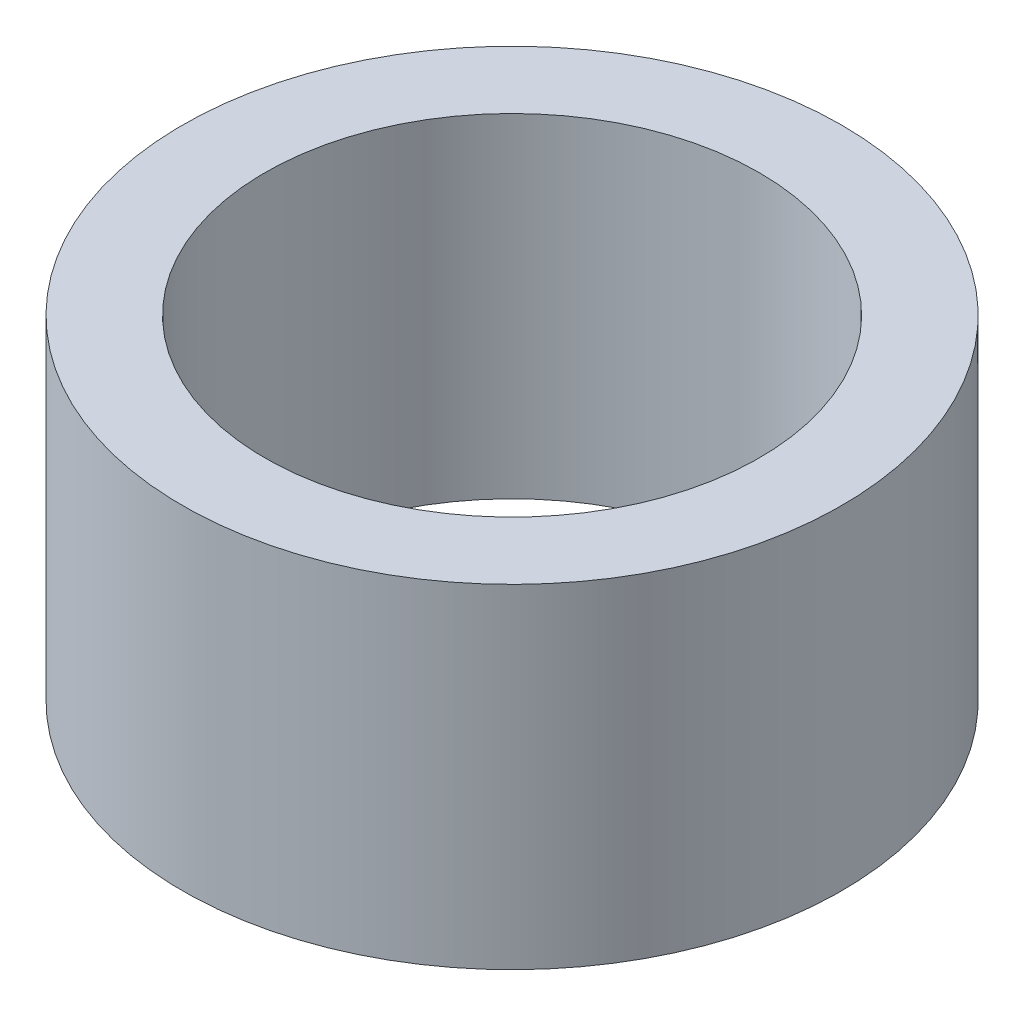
ISO-10303-21;
HEADER;
FILE_DESCRIPTION(('STEP AP214'),'2;1');
FILE_NAME('part.step','',(''),(''),'','','');
FILE_SCHEMA(('AUTOMOTIVE_DESIGN { 1 0 10303 214 1 1 1 1 }'));
ENDSEC;
DATA;
#1=APPLICATION_CONTEXT('core data for automotive mechanical design processes');
#2=APPLICATION_PROTOCOL_DEFINITION('international standard','automotive_design',2000,#1);
#3=PRODUCT_CONTEXT('',#1,'mechanical');
#4=PRODUCT('Part','Part','',(#3));
#5=PRODUCT_RELATED_PRODUCT_CATEGORY('part','',(#4));
#6=PRODUCT_DEFINITION_FORMATION('','',#4);
#7=PRODUCT_DEFINITION_CONTEXT('part definition',#1,'design');
#8=PRODUCT_DEFINITION('design','',#6,#7);
#9=PRODUCT_DEFINITION_SHAPE('','',#8);
#10=(LENGTH_UNIT() NAMED_UNIT(*) SI_UNIT(.MILLI.,.METRE.));
#11=(NAMED_UNIT(*) PLANE_ANGLE_UNIT() SI_UNIT($,.RADIAN.));
#12=(NAMED_UNIT(*) SI_UNIT($,.STERADIAN.) SOLID_ANGLE_UNIT());
#13=UNCERTAINTY_MEASURE_WITH_UNIT(LENGTH_MEASURE(1.E-05),#10,'distance_accuracy_value','');
#14=(GEOMETRIC_REPRESENTATION_CONTEXT(3) GLOBAL_UNCERTAINTY_ASSIGNED_CONTEXT((#13)) GLOBAL_UNIT_ASSIGNED_CONTEXT((#10,
#11,#12)) REPRESENTATION_CONTEXT('',''));
#15=CARTESIAN_POINT('',(0.,0.,0.));
#16=DIRECTION('',(0.,0.,1.));
#17=DIRECTION('',(1.,0.,0.));
#18=AXIS2_PLACEMENT_3D('',#15,#16,#17);
#19=CARTESIAN_POINT('',(0.,4.05,0.));
#20=DIRECTION('',(0.,-1.,0.));
#21=DIRECTION('',(0.,0.,-1.));
#22=AXIS2_PLACEMENT_3D('',#19,#20,#21);
#23=CYLINDRICAL_SURFACE('',#22,4.);
#24=CARTESIAN_POINT('',(0.,4.05,0.));
#25=DIRECTION('',(0.,-1.,0.));
#26=DIRECTION('',(0.,0.,-1.));
#27=AXIS2_PLACEMENT_3D('',#24,#25,#26);
#28=CIRCLE('',#27,4.);
#29=CARTESIAN_POINT('',(0.,4.05,-4.));
#30=VERTEX_POINT('',#29);
#31=EDGE_CURVE('E10',#30,#30,#28,.T.);
#32=ORIENTED_EDGE('',*,*,#31,.T.);
#33=EDGE_LOOP('',(#32));
#34=FACE_BOUND('',#33,.T.);
#35=CARTESIAN_POINT('',(0.,0.,0.));
#36=DIRECTION('',(0.,-1.,0.));
#37=DIRECTION('',(0.,0.,-1.));
#38=AXIS2_PLACEMENT_3D('',#35,#36,#37);
#39=CIRCLE('',#38,4.);
#40=CARTESIAN_POINT('',(0.,0.,-4.));
#41=VERTEX_POINT('',#40);
#42=EDGE_CURVE('E47',#41,#41,#39,.T.);
#43=ORIENTED_EDGE('',*,*,#42,.F.);
#44=EDGE_LOOP('',(#43));
#45=FACE_BOUND('',#44,.T.);
#46=ADVANCED_FACE('F33',(#34,#45),#23,.T.);
#47=CARTESIAN_POINT('',(4.,4.05,0.));
#48=DIRECTION('',(0.,1.,0.));
#49=DIRECTION('',(0.,0.,1.));
#50=AXIS2_PLACEMENT_3D('',#47,#48,#49);
#51=PLANE('',#50);
#52=CARTESIAN_POINT('',(0.,4.05,0.));
#53=DIRECTION('',(0.,-1.,0.));
#54=DIRECTION('',(0.,0.,-1.));
#55=AXIS2_PLACEMENT_3D('',#52,#53,#54);
#56=CIRCLE('',#55,3.);
#57=CARTESIAN_POINT('',(0.,4.05,-3.));
#58=VERTEX_POINT('',#57);
#59=EDGE_CURVE('E39',#58,#58,#56,.T.);
#60=ORIENTED_EDGE('',*,*,#59,.T.);
#61=EDGE_LOOP('',(#60));
#62=FACE_BOUND('',#61,.T.);
#63=ORIENTED_EDGE('',*,*,#31,.F.);
#64=EDGE_LOOP('',(#63));
#65=FACE_BOUND('',#64,.T.);
#66=ADVANCED_FACE('F57',(#62,#65),#51,.T.);
#67=CARTESIAN_POINT('',(0.,4.05,0.));
#68=DIRECTION('',(0.,-1.,0.));
#69=DIRECTION('',(0.,0.,-1.));
#70=AXIS2_PLACEMENT_3D('',#67,#68,#69);
#71=CYLINDRICAL_SURFACE('',#70,3.);
#72=CARTESIAN_POINT('',(0.,0.,0.));
#73=DIRECTION('',(0.,-1.,0.));
#74=DIRECTION('',(0.,0.,-1.));
#75=AXIS2_PLACEMENT_3D('',#72,#73,#74);
#76=CIRCLE('',#75,3.);
#77=CARTESIAN_POINT('',(0.,0.,-3.));
#78=VERTEX_POINT('',#77);
#79=EDGE_CURVE('E43',#78,#78,#76,.T.);
#80=ORIENTED_EDGE('',*,*,#79,.T.);
#81=EDGE_LOOP('',(#80));
#82=FACE_BOUND('',#81,.T.);
#83=ORIENTED_EDGE('',*,*,#59,.F.);
#84=EDGE_LOOP('',(#83));
#85=FACE_BOUND('',#84,.T.);
#86=ADVANCED_FACE('F61',(#82,#85),#71,.F.);
#87=CARTESIAN_POINT('',(3.,0.,0.));
#88=DIRECTION('',(0.,-1.,0.));
#89=DIRECTION('',(0.,0.,-1.));
#90=AXIS2_PLACEMENT_3D('',#87,#88,#89);
#91=PLANE('',#90);
#92=ORIENTED_EDGE('',*,*,#42,.T.);
#93=EDGE_LOOP('',(#92));
#94=FACE_BOUND('',#93,.T.);
#95=ORIENTED_EDGE('',*,*,#79,.F.);
#96=EDGE_LOOP('',(#95));
#97=FACE_BOUND('',#96,.T.);
#98=ADVANCED_FACE('F53',(#94,#97),#91,.T.);
#99=CLOSED_SHELL('',(#46,#66,#86,#98));
#100=MANIFOLD_SOLID_BREP('B2',#99);
#101=ADVANCED_BREP_SHAPE_REPRESENTATION('',(#18,#100),#14);
#102=SHAPE_DEFINITION_REPRESENTATION(#9,#101);
ENDSEC;
END-ISO-10303-21;
